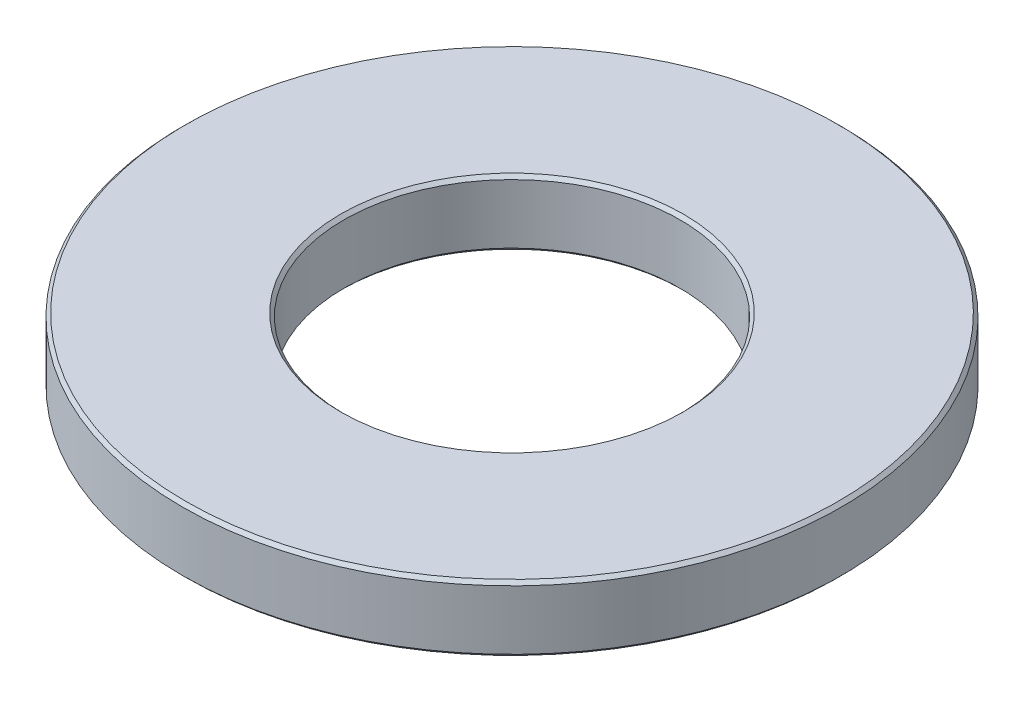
ISO-10303-21;
HEADER;
FILE_DESCRIPTION(('STEP AP214'),'2;1');
FILE_NAME('part.step','',(''),(''),'','','');
FILE_SCHEMA(('AUTOMOTIVE_DESIGN { 1 0 10303 214 1 1 1 1 }'));
ENDSEC;
DATA;
#1=APPLICATION_CONTEXT('core data for automotive mechanical design processes');
#2=APPLICATION_PROTOCOL_DEFINITION('international standard','automotive_design',2000,#1);
#3=PRODUCT_CONTEXT('',#1,'mechanical');
#4=PRODUCT('Part','Part','',(#3));
#5=PRODUCT_RELATED_PRODUCT_CATEGORY('part','',(#4));
#6=PRODUCT_DEFINITION_FORMATION('','',#4);
#7=PRODUCT_DEFINITION_CONTEXT('part definition',#1,'design');
#8=PRODUCT_DEFINITION('design','',#6,#7);
#9=PRODUCT_DEFINITION_SHAPE('','',#8);
#10=(LENGTH_UNIT() NAMED_UNIT(*) SI_UNIT(.MILLI.,.METRE.));
#11=(NAMED_UNIT(*) PLANE_ANGLE_UNIT() SI_UNIT($,.RADIAN.));
#12=(NAMED_UNIT(*) SI_UNIT($,.STERADIAN.) SOLID_ANGLE_UNIT());
#13=UNCERTAINTY_MEASURE_WITH_UNIT(LENGTH_MEASURE(1.E-05),#10,'distance_accuracy_value','');
#14=(GEOMETRIC_REPRESENTATION_CONTEXT(3) GLOBAL_UNCERTAINTY_ASSIGNED_CONTEXT((#13)) GLOBAL_UNIT_ASSIGNED_CONTEXT((#10,
#11,#12)) REPRESENTATION_CONTEXT('',''));
#15=CARTESIAN_POINT('',(0.,0.,0.));
#16=DIRECTION('',(0.,0.,1.));
#17=DIRECTION('',(1.,0.,0.));
#18=AXIS2_PLACEMENT_3D('',#15,#16,#17);
#19=CARTESIAN_POINT('',(0.,2.,0.));
#20=DIRECTION('',(0.,1.,0.));
#21=DIRECTION('',(0.,0.,1.));
#22=AXIS2_PLACEMENT_3D('',#19,#20,#21);
#23=PLANE('',#22);
#24=CARTESIAN_POINT('',(0.,2.,0.));
#25=DIRECTION('',(0.,1.,0.));
#26=DIRECTION('',(0.,0.,1.));
#27=AXIS2_PLACEMENT_3D('',#24,#25,#26);
#28=CIRCLE('',#27,5.2);
#29=CARTESIAN_POINT('',(0.,2.,5.2));
#30=VERTEX_POINT('',#29);
#31=EDGE_CURVE('E52',#30,#30,#28,.F.);
#32=ORIENTED_EDGE('',*,*,#31,.T.);
#33=EDGE_LOOP('',(#32));
#34=FACE_BOUND('',#33,.T.);
#35=CARTESIAN_POINT('',(0.,2.,0.));
#36=DIRECTION('',(0.,1.,0.));
#37=DIRECTION('',(0.,0.,1.));
#38=AXIS2_PLACEMENT_3D('',#35,#36,#37);
#39=CIRCLE('',#38,9.9);
#40=CARTESIAN_POINT('',(0.,2.,9.9));
#41=VERTEX_POINT('',#40);
#42=EDGE_CURVE('E55',#41,#41,#39,.T.);
#43=ORIENTED_EDGE('',*,*,#42,.T.);
#44=EDGE_LOOP('',(#43));
#45=FACE_BOUND('',#44,.T.);
#46=ADVANCED_FACE('F32',(#34,#45),#23,.T.);
#47=CARTESIAN_POINT('',(0.,0.,0.));
#48=DIRECTION('',(0.,1.,0.));
#49=DIRECTION('',(0.,0.,1.));
#50=AXIS2_PLACEMENT_3D('',#47,#48,#49);
#51=PLANE('',#50);
#52=CARTESIAN_POINT('',(0.,0.,0.));
#53=DIRECTION('',(0.,1.,0.));
#54=DIRECTION('',(0.,0.,1.));
#55=AXIS2_PLACEMENT_3D('',#52,#53,#54);
#56=CIRCLE('',#55,9.9);
#57=CARTESIAN_POINT('',(0.,0.,9.9));
#58=VERTEX_POINT('',#57);
#59=EDGE_CURVE('E10',#58,#58,#56,.F.);
#60=ORIENTED_EDGE('',*,*,#59,.T.);
#61=EDGE_LOOP('',(#60));
#62=FACE_BOUND('',#61,.T.);
#63=CARTESIAN_POINT('',(0.,0.,0.));
#64=DIRECTION('',(0.,1.,0.));
#65=DIRECTION('',(0.,0.,1.));
#66=AXIS2_PLACEMENT_3D('',#63,#64,#65);
#67=CIRCLE('',#66,5.2);
#68=CARTESIAN_POINT('',(0.,0.,5.2));
#69=VERTEX_POINT('',#68);
#70=EDGE_CURVE('E39',#69,#69,#67,.T.);
#71=ORIENTED_EDGE('',*,*,#70,.T.);
#72=EDGE_LOOP('',(#71));
#73=FACE_BOUND('',#72,.T.);
#74=ADVANCED_FACE('F79',(#62,#73),#51,.F.);
#75=CARTESIAN_POINT('',(0.,2.,0.));
#76=DIRECTION('',(0.,-1.,0.));
#77=DIRECTION('',(0.,0.,-1.));
#78=AXIS2_PLACEMENT_3D('',#75,#76,#77);
#79=CYLINDRICAL_SURFACE('',#78,10.);
#80=CARTESIAN_POINT('',(0.,1.9,0.));
#81=DIRECTION('',(0.,1.,0.));
#82=DIRECTION('',(0.,0.,1.));
#83=AXIS2_PLACEMENT_3D('',#80,#81,#82);
#84=CIRCLE('',#83,10.);
#85=CARTESIAN_POINT('',(0.,1.9,10.));
#86=VERTEX_POINT('',#85);
#87=EDGE_CURVE('E43',#86,#86,#84,.F.);
#88=ORIENTED_EDGE('',*,*,#87,.T.);
#89=EDGE_LOOP('',(#88));
#90=FACE_BOUND('',#89,.T.);
#91=CARTESIAN_POINT('',(0.,0.100000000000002,0.));
#92=DIRECTION('',(0.,1.,0.));
#93=DIRECTION('',(0.,0.,1.));
#94=AXIS2_PLACEMENT_3D('',#91,#92,#93);
#95=CIRCLE('',#94,10.);
#96=CARTESIAN_POINT('',(0.,0.100000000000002,10.));
#97=VERTEX_POINT('',#96);
#98=EDGE_CURVE('E47',#97,#97,#95,.T.);
#99=ORIENTED_EDGE('',*,*,#98,.T.);
#100=EDGE_LOOP('',(#99));
#101=FACE_BOUND('',#100,.T.);
#102=ADVANCED_FACE('F34',(#90,#101),#79,.T.);
#103=CARTESIAN_POINT('',(0.,2.,0.));
#104=DIRECTION('',(0.,-1.,0.));
#105=DIRECTION('',(0.,0.,-1.));
#106=AXIS2_PLACEMENT_3D('',#103,#104,#105);
#107=CYLINDRICAL_SURFACE('',#106,5.1);
#108=CARTESIAN_POINT('',(0.,1.9,0.));
#109=DIRECTION('',(0.,1.,0.));
#110=DIRECTION('',(0.,0.,1.));
#111=AXIS2_PLACEMENT_3D('',#108,#109,#110);
#112=CIRCLE('',#111,5.1);
#113=CARTESIAN_POINT('',(0.,1.9,5.1));
#114=VERTEX_POINT('',#113);
#115=EDGE_CURVE('E58',#114,#114,#112,.T.);
#116=ORIENTED_EDGE('',*,*,#115,.T.);
#117=EDGE_LOOP('',(#116));
#118=FACE_BOUND('',#117,.T.);
#119=CARTESIAN_POINT('',(0.,0.100000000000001,0.));
#120=DIRECTION('',(0.,1.,0.));
#121=DIRECTION('',(0.,0.,1.));
#122=AXIS2_PLACEMENT_3D('',#119,#120,#121);
#123=CIRCLE('',#122,5.1);
#124=CARTESIAN_POINT('',(0.,0.100000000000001,5.1));
#125=VERTEX_POINT('',#124);
#126=EDGE_CURVE('E61',#125,#125,#123,.F.);
#127=ORIENTED_EDGE('',*,*,#126,.T.);
#128=EDGE_LOOP('',(#127));
#129=FACE_BOUND('',#128,.T.);
#130=ADVANCED_FACE('F65',(#118,#129),#107,.F.);
#131=CARTESIAN_POINT('',(0.,1.9,0.));
#132=DIRECTION('',(0.,1.,0.));
#133=DIRECTION('',(0.,0.,1.));
#134=AXIS2_PLACEMENT_3D('',#131,#132,#133);
#135=CONICAL_SURFACE('',#134,5.1,0.785398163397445);
#136=ORIENTED_EDGE('',*,*,#31,.F.);
#137=EDGE_LOOP('',(#136));
#138=FACE_BOUND('',#137,.T.);
#139=ORIENTED_EDGE('',*,*,#115,.F.);
#140=EDGE_LOOP('',(#139));
#141=FACE_BOUND('',#140,.T.);
#142=ADVANCED_FACE('F89',(#138,#141),#135,.F.);
#143=CARTESIAN_POINT('',(0.,2.,0.));
#144=DIRECTION('',(0.,-1.,0.));
#145=DIRECTION('',(0.,0.,-1.));
#146=AXIS2_PLACEMENT_3D('',#143,#144,#145);
#147=CONICAL_SURFACE('',#146,9.9,0.78539816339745);
#148=ORIENTED_EDGE('',*,*,#87,.F.);
#149=EDGE_LOOP('',(#148));
#150=FACE_BOUND('',#149,.T.);
#151=ORIENTED_EDGE('',*,*,#42,.F.);
#152=EDGE_LOOP('',(#151));
#153=FACE_BOUND('',#152,.T.);
#154=ADVANCED_FACE('F75',(#150,#153),#147,.T.);
#155=CARTESIAN_POINT('',(0.,0.100000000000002,0.));
#156=DIRECTION('',(0.,1.,0.));
#157=DIRECTION('',(0.,0.,1.));
#158=AXIS2_PLACEMENT_3D('',#155,#156,#157);
#159=CONICAL_SURFACE('',#158,10.,0.785398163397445);
#160=ORIENTED_EDGE('',*,*,#59,.F.);
#161=EDGE_LOOP('',(#160));
#162=FACE_BOUND('',#161,.T.);
#163=ORIENTED_EDGE('',*,*,#98,.F.);
#164=EDGE_LOOP('',(#163));
#165=FACE_BOUND('',#164,.T.);
#166=ADVANCED_FACE('F70',(#162,#165),#159,.T.);
#167=CARTESIAN_POINT('',(0.,0.,0.));
#168=DIRECTION('',(0.,-1.,0.));
#169=DIRECTION('',(0.,0.,-1.));
#170=AXIS2_PLACEMENT_3D('',#167,#168,#169);
#171=CONICAL_SURFACE('',#170,5.2,0.785398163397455);
#172=ORIENTED_EDGE('',*,*,#126,.F.);
#173=EDGE_LOOP('',(#172));
#174=FACE_BOUND('',#173,.T.);
#175=ORIENTED_EDGE('',*,*,#70,.F.);
#176=EDGE_LOOP('',(#175));
#177=FACE_BOUND('',#176,.T.);
#178=ADVANCED_FACE('F67',(#174,#177),#171,.F.);
#179=CLOSED_SHELL('',(#46,#74,#102,#130,#142,#154,#166,#178));
#180=MANIFOLD_SOLID_BREP('B2',#179);
#181=ADVANCED_BREP_SHAPE_REPRESENTATION('',(#18,#180),#14);
#182=SHAPE_DEFINITION_REPRESENTATION(#9,#181);
ENDSEC;
END-ISO-10303-21;
